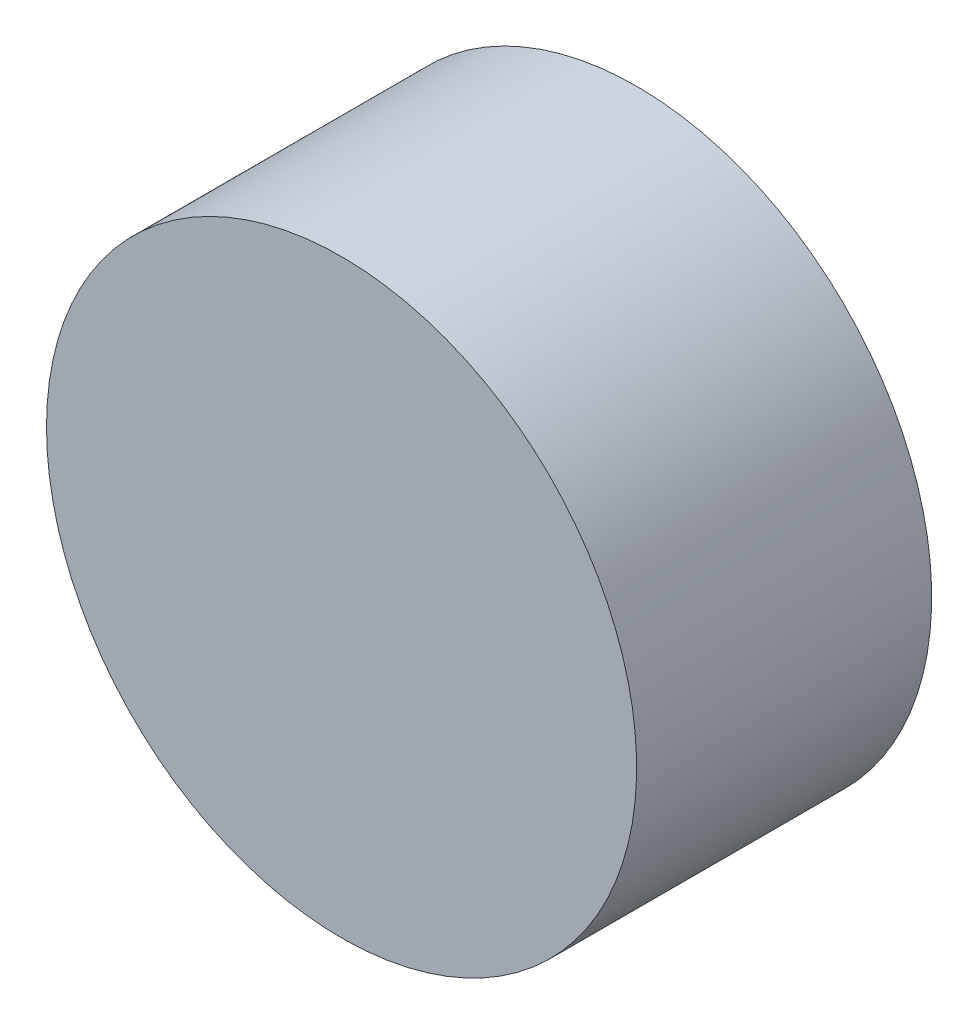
from build123d import *

# Parameters (mm, degrees)
ESQUISSE1_R      = 3
EXTRUSION1_DEPTH = 3


with BuildPart() as part:
    # Esquisse1 → Extrusion1 (new body)
    with BuildSketch(Plane.XY):
        Circle(ESQUISSE1_R)
    extrude(amount=EXTRUSION1_DEPTH)


solid = part.part
